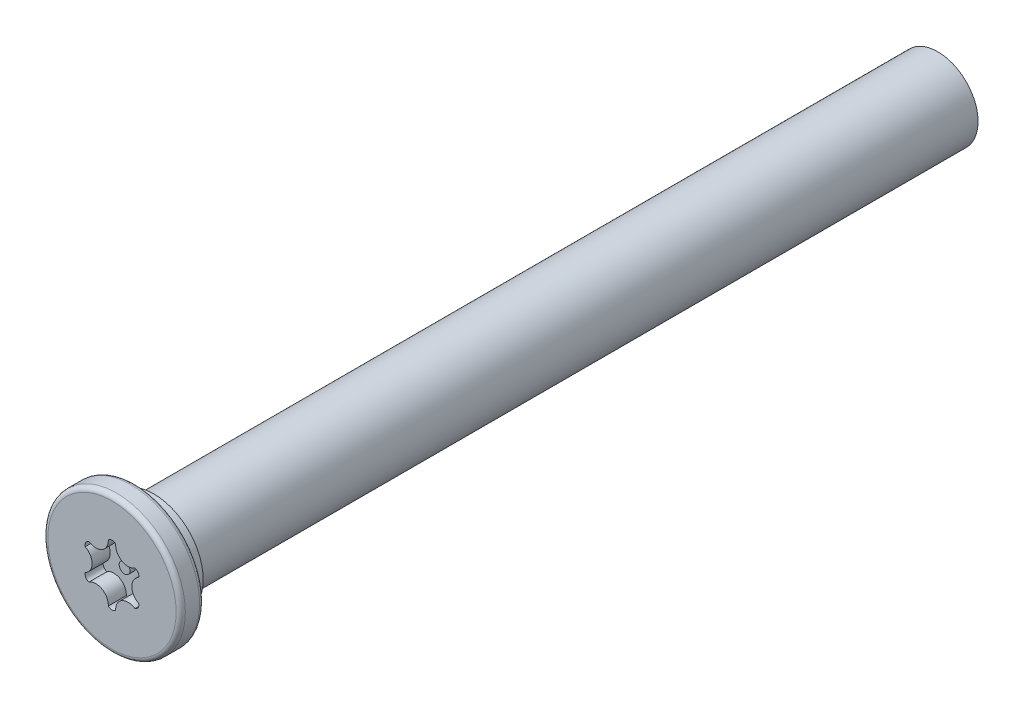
from build123d import *

# Parameters (mm, degrees)
SKETCH2_W           = 1.3
SKETCH2_H           = 3.81
SKETCH2_W_2         = 12.7
SKETCH2_H_2         = 2.23
CUT_EXTRUDE3_DEPTH  = 1
FILLET12_R          = 0.254
CUT_EXTRUDE6_START  = -12.7
SKETCH7_R           = 2.23
CUT_EXTRUDE6_DEPTH  = 12.7
SKETCH11_R          = 2.738000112
SKETCH11_R_2        = 2.230000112
BOSS_EXTRUDE1_DEPTH = 1.016
SKETCH12_R          = 2.230000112
BOSS_EXTRUDE2_DEPTH = 12.7
SKETCH14_R          = 0.3
BOSS_EXTRUDE4_DEPTH = 0.3
CUT_EXTRUDE7_START  = -12.7
SKETCH15_R          = 2.230000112
CUT_EXTRUDE7_DEPTH  = 12.7
SKETCH16_R          = 2.230000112
BOSS_EXTRUDE5_DEPTH = 44.45


with BuildPart() as part:
    # Sketch2 → Revolve1 (revolve)
    with BuildSketch(Plane(origin=(0, 0, 0), x_dir=(0, 0, -1), z_dir=(1, 0, 0)), mode=Mode.PRIVATE) as revolve1_sk:
        with Locations((0.65, 1.905)):
            Rectangle(SKETCH2_W, SKETCH2_H)
        with Locations((7.65, 1.115)):
            Rectangle(SKETCH2_W_2, SKETCH2_H_2)
    revolve(revolve1_sk.sketch.rotate(Axis((0, 0, -1.3), (0, 0, -1)), 90), axis=Axis((0, 0, -1.3), (0, 0, -1)))

    # Sketch3 → Cut-Extrude3 (cut)
    with BuildSketch(Plane.XY):
        with BuildLine():
            ThreePointArc((-0.205060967, 1.589373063), (0, 1.674312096), (0.205060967, 1.589373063))
            ThreePointArc((0.205060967, 1.589373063), (0.54882888, 0.950599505), (1.273906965, 0.972274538))
            ThreePointArc((1.273906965, 0.972274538), (1.449996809, 0.837156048), (1.478967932, 0.617098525))
            ThreePointArc((1.478967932, 0.617098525), (1.097657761, 0), (1.478967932, -0.617098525))
            ThreePointArc((1.478967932, -0.617098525), (1.449996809, -0.837156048), (1.273906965, -0.972274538))
            ThreePointArc((1.273906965, -0.972274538), (0.54882888, -0.950599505), (0.205060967, -1.589373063))
            ThreePointArc((0.205060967, -1.589373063), (0, -1.674312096), (-0.205060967, -1.589373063))
            ThreePointArc((-0.205060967, -1.589373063), (-0.54882888, -0.950599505), (-1.273906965, -0.972274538))
            ThreePointArc((-1.273906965, -0.972274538), (-1.449996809, -0.837156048), (-1.478967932, -0.617098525))
            ThreePointArc((-1.478967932, -0.617098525), (-1.097657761, 0), (-1.478967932, 0.617098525))
            ThreePointArc((-1.478967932, 0.617098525), (-1.449996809, 0.837156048), (-1.273906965, 0.972274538))
            ThreePointArc((-1.273906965, 0.972274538), (-0.54882888, 0.950599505), (-0.205060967, 1.589373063))
        make_face()
    extrude(amount=-CUT_EXTRUDE3_DEPTH, mode=Mode.SUBTRACT)

    # Fillet12
    fillet12_edges = [part.edges().sort_by_distance(p)[0] for p in [
        (-3.81, 0, 0),
        (-3.81, 0, -1.3),
    ]]
    fillet(fillet12_edges, radius=FILLET12_R)

    # Sketch7 → Cut-Extrude6 (cut)
    with BuildSketch(Plane(origin=(0, 0, -14), x_dir=(-1, 0, 0), z_dir=(0, 0, -1)).offset(CUT_EXTRUDE6_START)):
        Circle(SKETCH7_R)
    extrude(amount=CUT_EXTRUDE6_DEPTH, mode=Mode.SUBTRACT)

    # Sketch11 → Boss-Extrude1 (add)
    with BuildSketch(Plane(origin=(0, 0, -1.3), x_dir=(-1, 0, 0), z_dir=(0, 0, -1))):
        with Locations(Location((0, 0, 0), (0, 0, 180))):
            Circle(SKETCH11_R)
        Circle(SKETCH11_R_2, mode=Mode.SUBTRACT)
    extrude(amount=BOSS_EXTRUDE1_DEPTH)

    # Sketch12 → Boss-Extrude2 (add)
    with BuildSketch(Plane(origin=(0, 0, -1.3), x_dir=(-1, 0, 0), z_dir=(0, 0, -1))):
        Circle(SKETCH12_R)
    extrude(amount=BOSS_EXTRUDE2_DEPTH)

    # Sketch14 → Boss-Extrude4 (add)
    with BuildSketch(Plane.XY.offset(-1)):
        Circle(SKETCH14_R)
    extrude(amount=BOSS_EXTRUDE4_DEPTH)

    # Sketch15 → Cut-Extrude7 (cut)
    with BuildSketch(Plane(origin=(0, 0, -14), x_dir=(-1, 0, 0), z_dir=(0, 0, -1)).offset(CUT_EXTRUDE7_START)):
        Circle(SKETCH15_R)
    extrude(amount=CUT_EXTRUDE7_DEPTH, mode=Mode.SUBTRACT)

    # Sketch16 → Boss-Extrude5 (add)
    with BuildSketch(Plane(origin=(0, 0, -1.3), x_dir=(-1, 0, 0), z_dir=(0, 0, -1))):
        Circle(SKETCH16_R)
    extrude(amount=BOSS_EXTRUDE5_DEPTH)


solid = part.part
